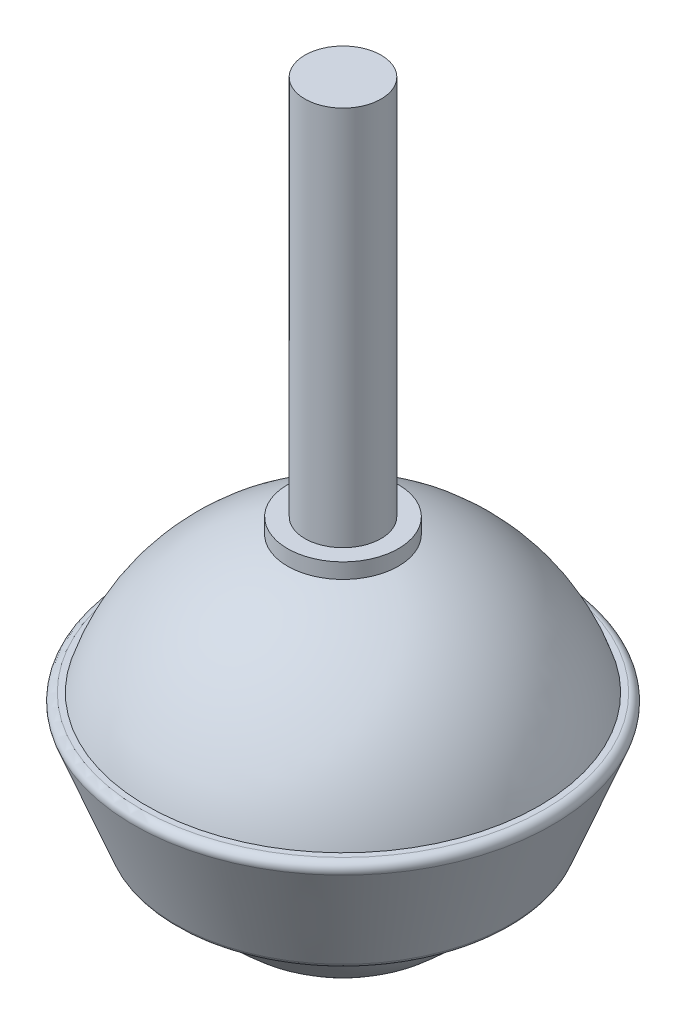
ISO-10303-21;
HEADER;
FILE_DESCRIPTION(('STEP AP214'),'2;1');
FILE_NAME('part.step','',(''),(''),'','','');
FILE_SCHEMA(('AUTOMOTIVE_DESIGN { 1 0 10303 214 1 1 1 1 }'));
ENDSEC;
DATA;
#1=APPLICATION_CONTEXT('core data for automotive mechanical design processes');
#2=APPLICATION_PROTOCOL_DEFINITION('international standard','automotive_design',2000,#1);
#3=PRODUCT_CONTEXT('',#1,'mechanical');
#4=PRODUCT('Part','Part','',(#3));
#5=PRODUCT_RELATED_PRODUCT_CATEGORY('part','',(#4));
#6=PRODUCT_DEFINITION_FORMATION('','',#4);
#7=PRODUCT_DEFINITION_CONTEXT('part definition',#1,'design');
#8=PRODUCT_DEFINITION('design','',#6,#7);
#9=PRODUCT_DEFINITION_SHAPE('','',#8);
#10=(LENGTH_UNIT() NAMED_UNIT(*) SI_UNIT(.MILLI.,.METRE.));
#11=(NAMED_UNIT(*) PLANE_ANGLE_UNIT() SI_UNIT($,.RADIAN.));
#12=(NAMED_UNIT(*) SI_UNIT($,.STERADIAN.) SOLID_ANGLE_UNIT());
#13=UNCERTAINTY_MEASURE_WITH_UNIT(LENGTH_MEASURE(1.E-05),#10,'distance_accuracy_value','');
#14=(GEOMETRIC_REPRESENTATION_CONTEXT(3) GLOBAL_UNCERTAINTY_ASSIGNED_CONTEXT((#13)) GLOBAL_UNIT_ASSIGNED_CONTEXT((#10,
#11,#12)) REPRESENTATION_CONTEXT('',''));
#15=CARTESIAN_POINT('',(0.,0.,0.));
#16=DIRECTION('',(0.,0.,1.));
#17=DIRECTION('',(1.,0.,0.));
#18=AXIS2_PLACEMENT_3D('',#15,#16,#17);
#19=CARTESIAN_POINT('',(0.,-78.,0.));
#20=DIRECTION('',(0.,1.,0.));
#21=DIRECTION('',(-1.,0.,0.));
#22=AXIS2_PLACEMENT_3D('',#19,#20,#21);
#23=SPHERICAL_SURFACE('',#22,20.);
#24=CARTESIAN_POINT('',(0.,-86.,0.));
#25=DIRECTION('',(0.,1.,0.));
#26=DIRECTION('',(-1.,0.,0.));
#27=AXIS2_PLACEMENT_3D('',#24,#25,#26);
#28=CIRCLE('',#27,18.3303027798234);
#29=CARTESIAN_POINT('',(-18.3303027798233,-86.,0.));
#30=VERTEX_POINT('',#29);
#31=EDGE_CURVE('E10',#30,#30,#28,.T.);
#32=ORIENTED_EDGE('',*,*,#31,.F.);
#33=EDGE_LOOP('',(#32));
#34=FACE_BOUND('',#33,.T.);
#35=ADVANCED_FACE('F30',(#34),#23,.T.);
#36=CARTESIAN_POINT('',(21.0674801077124,-86.,0.));
#37=DIRECTION('',(0.,1.,0.));
#38=DIRECTION('',(-1.,0.,0.));
#39=AXIS2_PLACEMENT_3D('',#36,#37,#38);
#40=PLANE('',#39);
#41=CARTESIAN_POINT('',(0.,-86.,0.));
#42=DIRECTION('',(0.,1.,0.));
#43=DIRECTION('',(-1.,0.,0.));
#44=AXIS2_PLACEMENT_3D('',#41,#42,#43);
#45=CIRCLE('',#44,21.0674801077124);
#46=CARTESIAN_POINT('',(-21.0674801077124,-86.,0.));
#47=VERTEX_POINT('',#46);
#48=EDGE_CURVE('E36',#47,#47,#45,.T.);
#49=ORIENTED_EDGE('',*,*,#48,.F.);
#50=EDGE_LOOP('',(#49));
#51=FACE_BOUND('',#50,.T.);
#52=ORIENTED_EDGE('',*,*,#31,.T.);
#53=EDGE_LOOP('',(#52));
#54=FACE_BOUND('',#53,.T.);
#55=ADVANCED_FACE('F114',(#51,#54),#40,.F.);
#56=CARTESIAN_POINT('',(0.,-85.,0.));
#57=DIRECTION('',(0.,1.,0.));
#58=DIRECTION('',(-1.,0.,0.));
#59=AXIS2_PLACEMENT_3D('',#56,#57,#58);
#60=TOROIDAL_SURFACE('',#59,21.0674801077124,1.);
#61=CARTESIAN_POINT('',(0.,-85.3638273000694,0.));
#62=DIRECTION('',(0.,1.,0.));
#63=DIRECTION('',(-1.,0.,0.));
#64=AXIS2_PLACEMENT_3D('',#61,#62,#63);
#65=CIRCLE('',#64,21.9989465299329);
#66=CARTESIAN_POINT('',(-21.9989465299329,-85.3638273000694,0.));
#67=VERTEX_POINT('',#66);
#68=EDGE_CURVE('E40',#67,#67,#65,.T.);
#69=ORIENTED_EDGE('',*,*,#68,.F.);
#70=EDGE_LOOP('',(#69));
#71=FACE_BOUND('',#70,.T.);
#72=ORIENTED_EDGE('',*,*,#48,.T.);
#73=EDGE_LOOP('',(#72));
#74=FACE_BOUND('',#73,.T.);
#75=ADVANCED_FACE('F109',(#71,#74),#60,.T.);
#76=CARTESIAN_POINT('',(0.,-85.3638273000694,0.));
#77=DIRECTION('',(0.,1.,0.));
#78=DIRECTION('',(-1.,0.,0.));
#79=AXIS2_PLACEMENT_3D('',#76,#77,#78);
#80=CONICAL_SURFACE('',#79,21.9989465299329,0.372373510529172);
#81=CARTESIAN_POINT('',(0.,-71.3638273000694,0.));
#82=DIRECTION('',(0.,1.,0.));
#83=DIRECTION('',(-1.,0.,0.));
#84=AXIS2_PLACEMENT_3D('',#81,#82,#83);
#85=CIRCLE('',#84,27.4672941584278);
#86=CARTESIAN_POINT('',(-27.4672941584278,-71.3638273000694,0.));
#87=VERTEX_POINT('',#86);
#88=EDGE_CURVE('E44',#87,#87,#85,.T.);
#89=ORIENTED_EDGE('',*,*,#88,.F.);
#90=EDGE_LOOP('',(#89));
#91=FACE_BOUND('',#90,.T.);
#92=ORIENTED_EDGE('',*,*,#68,.T.);
#93=EDGE_LOOP('',(#92));
#94=FACE_BOUND('',#93,.T.);
#95=ADVANCED_FACE('F103',(#91,#94),#80,.T.);
#96=CARTESIAN_POINT('',(0.,-71.,0.));
#97=DIRECTION('',(0.,1.,0.));
#98=DIRECTION('',(-1.,0.,0.));
#99=AXIS2_PLACEMENT_3D('',#96,#97,#98);
#100=TOROIDAL_SURFACE('',#99,26.5358277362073,0.999999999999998);
#101=CARTESIAN_POINT('',(0.,-70.,0.));
#102=DIRECTION('',(0.,1.,0.));
#103=DIRECTION('',(-1.,0.,0.));
#104=AXIS2_PLACEMENT_3D('',#101,#102,#103);
#105=CIRCLE('',#104,26.5358277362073);
#106=CARTESIAN_POINT('',(-26.5358277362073,-70.,0.));
#107=VERTEX_POINT('',#106);
#108=EDGE_CURVE('E49',#107,#107,#105,.T.);
#109=ORIENTED_EDGE('',*,*,#108,.F.);
#110=EDGE_LOOP('',(#109));
#111=FACE_BOUND('',#110,.T.);
#112=ORIENTED_EDGE('',*,*,#88,.T.);
#113=EDGE_LOOP('',(#112));
#114=FACE_BOUND('',#113,.T.);
#115=ADVANCED_FACE('F97',(#111,#114),#100,.T.);
#116=CARTESIAN_POINT('',(25.7875939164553,-70.,0.));
#117=DIRECTION('',(0.,-1.,0.));
#118=DIRECTION('',(1.,0.,0.));
#119=AXIS2_PLACEMENT_3D('',#116,#117,#118);
#120=PLANE('',#119);
#121=CARTESIAN_POINT('',(0.,-70.,0.));
#122=DIRECTION('',(0.,1.,0.));
#123=DIRECTION('',(-1.,0.,0.));
#124=AXIS2_PLACEMENT_3D('',#121,#122,#123);
#125=CIRCLE('',#124,25.7875939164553);
#126=CARTESIAN_POINT('',(25.7875939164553,-70.,0.));
#127=VERTEX_POINT('',#126);
#128=EDGE_CURVE('E52',#127,#127,#125,.T.);
#129=ORIENTED_EDGE('',*,*,#128,.F.);
#130=EDGE_LOOP('',(#129));
#131=FACE_BOUND('',#130,.T.);
#132=ORIENTED_EDGE('',*,*,#108,.T.);
#133=EDGE_LOOP('',(#132));
#134=FACE_BOUND('',#133,.T.);
#135=ADVANCED_FACE('F91',(#131,#134),#120,.F.);
#136=CARTESIAN_POINT('',(0.,-78.,0.));
#137=DIRECTION('',(0.,1.,0.));
#138=DIRECTION('',(1.,0.,0.));
#139=AXIS2_PLACEMENT_3D('',#136,#137,#138);
#140=SPHERICAL_SURFACE('',#139,27.);
#141=CARTESIAN_POINT('',(0.,-52.,0.));
#142=DIRECTION('',(0.,1.,0.));
#143=DIRECTION('',(-1.,0.,0.));
#144=AXIS2_PLACEMENT_3D('',#141,#142,#143);
#145=CIRCLE('',#144,7.28010988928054);
#146=CARTESIAN_POINT('',(7.28010988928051,-52.,0.));
#147=VERTEX_POINT('',#146);
#148=EDGE_CURVE('E55',#147,#147,#145,.T.);
#149=CARTESIAN_POINT('',(7.28010988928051,-52.,0.));
#150=CARTESIAN_POINT('',(7.55012338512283,-52.0756033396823,0.));
#151=CARTESIAN_POINT('',(7.81895824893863,-52.1554157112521,0.));
#152=CARTESIAN_POINT('',(8.35401179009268,-52.3233746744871,0.));
#153=CARTESIAN_POINT('',(8.62023046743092,-52.4115212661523,0.));
#154=CARTESIAN_POINT('',(9.14979271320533,-52.5960648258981,0.));
#155=CARTESIAN_POINT('',(9.4131362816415,-52.6924617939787,0.));
#156=CARTESIAN_POINT('',(9.93669285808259,-52.8934120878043,0.));
#157=CARTESIAN_POINT('',(10.1969058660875,-52.9979654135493,0.));
#158=CARTESIAN_POINT('',(10.7139487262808,-53.2151270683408,0.));
#159=CARTESIAN_POINT('',(10.9707785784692,-53.3277353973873,0.));
#160=CARTESIAN_POINT('',(11.4808058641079,-53.5608977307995,0.));
#161=CARTESIAN_POINT('',(11.7340032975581,-53.6814517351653,0.));
#162=CARTESIAN_POINT('',(12.2365199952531,-53.9303884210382,0.));
#163=CARTESIAN_POINT('',(12.4858392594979,-54.0587711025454,0.));
#164=CARTESIAN_POINT('',(12.9803576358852,-54.3232405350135,0.));
#165=CARTESIAN_POINT('',(13.2255567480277,-54.4593272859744,0.));
#166=CARTESIAN_POINT('',(13.7115968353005,-54.7390727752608,0.));
#167=CARTESIAN_POINT('',(13.9524378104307,-54.8827315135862,0.));
#168=CARTESIAN_POINT('',(14.4295278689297,-55.1774815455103,0.));
#169=CARTESIAN_POINT('',(14.6657769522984,-55.3285728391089,0.));
#170=CARTESIAN_POINT('',(15.1334539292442,-55.6380413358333,0.));
#171=CARTESIAN_POINT('',(15.3648818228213,-55.796418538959,0.));
#172=CARTESIAN_POINT('',(15.8226918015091,-56.1203051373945,0.));
#173=CARTESIAN_POINT('',(16.0490738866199,-56.2858145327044,0.));
#174=CARTESIAN_POINT('',(16.4965725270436,-56.6238048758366,0.));
#175=CARTESIAN_POINT('',(16.7176890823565,-56.7962858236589,0.));
#176=CARTESIAN_POINT('',(17.1544420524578,-57.1480518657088,0.));
#177=CARTESIAN_POINT('',(17.3700784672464,-57.3273369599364,0.));
#178=CARTESIAN_POINT('',(17.7956618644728,-57.6925372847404,0.));
#179=CARTESIAN_POINT('',(18.0056088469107,-57.8784525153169,0.));
#180=CARTESIAN_POINT('',(18.4196096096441,-58.2567326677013,0.));
#181=CARTESIAN_POINT('',(18.6236633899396,-58.4490975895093,0.));
#182=CARTESIAN_POINT('',(19.0256796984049,-58.8400904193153,0.));
#183=CARTESIAN_POINT('',(19.2236422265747,-59.0387183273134,0.));
#184=CARTESIAN_POINT('',(19.6132838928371,-59.4420443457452,0.));
#185=CARTESIAN_POINT('',(19.8049630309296,-59.646742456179,0.));
#186=CARTESIAN_POINT('',(20.1818518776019,-60.062010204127,0.));
#187=CARTESIAN_POINT('',(20.3670615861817,-60.2725798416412,0.));
#188=CARTESIAN_POINT('',(20.7308318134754,-60.699386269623,0.));
#189=CARTESIAN_POINT('',(20.9093923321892,-60.9156230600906,0.));
#190=CARTESIAN_POINT('',(21.2596908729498,-61.3535539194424,0.));
#191=CARTESIAN_POINT('',(21.4314288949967,-61.5752479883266,0.));
#192=CARTESIAN_POINT('',(21.7679157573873,-62.023878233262,0.));
#193=CARTESIAN_POINT('',(21.9326645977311,-62.2508144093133,0.));
#194=CARTESIAN_POINT('',(22.255013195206,-62.7097086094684,0.));
#195=CARTESIAN_POINT('',(22.4126129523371,-62.9416666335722,0.));
#196=CARTESIAN_POINT('',(22.7205104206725,-63.4103793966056,0.));
#197=CARTESIAN_POINT('',(22.8708081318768,-63.6471341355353,0.));
#198=CARTESIAN_POINT('',(23.163955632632,-64.1252105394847,0.));
#199=CARTESIAN_POINT('',(23.3068054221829,-64.3665322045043,0.));
#200=CARTESIAN_POINT('',(23.584918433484,-64.8535082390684,0.));
#201=CARTESIAN_POINT('',(23.7201816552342,-65.0991626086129,0.));
#202=CARTESIAN_POINT('',(23.982990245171,-65.594565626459,0.));
#203=CARTESIAN_POINT('',(24.1105356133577,-65.8443142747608,0.));
#204=CARTESIAN_POINT('',(24.3577847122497,-66.3476634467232,0.));
#205=CARTESIAN_POINT('',(24.4774884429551,-66.6012639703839,0.));
#206=CARTESIAN_POINT('',(24.7089380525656,-67.1120707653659,0.));
#207=CARTESIAN_POINT('',(24.8206839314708,-67.3692770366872,0.));
#208=CARTESIAN_POINT('',(25.0361095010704,-67.8870456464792,0.));
#209=CARTESIAN_POINT('',(25.1397891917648,-68.14760798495,0.));
#210=CARTESIAN_POINT('',(25.3389813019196,-68.6718359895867,0.));
#211=CARTESIAN_POINT('',(25.4344937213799,-68.9355016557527,0.));
#212=CARTESIAN_POINT('',(25.6172602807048,-69.4656798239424,0.));
#213=CARTESIAN_POINT('',(25.7045144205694,-69.7321923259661,0.));
#214=CARTESIAN_POINT('',(25.7875939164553,-70.,0.));
#215=B_SPLINE_CURVE_WITH_KNOTS('',3,(#149,#150,#151,#152,#153,#154,#155,#156,#157,#158,#159,
#160,#161,#162,#163,#164,#165,#166,#167,#168,#169,#170,#171,#172,#173,#174,#175,#176,#177,#178,
#179,#180,#181,#182,#183,#184,#185,#186,#187,#188,#189,#190,#191,#192,#193,#194,#195,#196,#197,
#198,#199,#200,#201,#202,#203,#204,#205,#206,#207,#208,#209,#210,#211,#212,#213,#214),
.UNSPECIFIED.,.F.,.F.,(4,2,2,2,2,2,2,2,2,2,2,2,2,2,2,2,2,2,2,2,2,2,2,2,2,2,2,2,2,2,2,2,4),(0.,
0.841160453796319,1.68232090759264,2.52348136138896,3.36464181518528,4.2058022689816,
5.04696272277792,5.88812317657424,6.72928363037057,7.57044408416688,8.41160453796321,
9.25276499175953,10.0939254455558,10.9350858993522,11.7762463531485,12.6174068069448,
13.4585672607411,14.2997277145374,15.1408881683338,15.9820486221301,16.8232090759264,
17.6643695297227,18.505529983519,19.3466904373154,20.1878508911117,21.029011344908,
21.8701717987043,22.7113322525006,23.552492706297,24.3936531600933,25.2348136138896,
26.0759740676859,26.9171345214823),.UNSPECIFIED.);
#216=EDGE_CURVE('BSEAM85',#147,#127,#215,.T.);
#217=ORIENTED_EDGE('',*,*,#148,.F.);
#218=ORIENTED_EDGE('',*,*,#128,.T.);
#219=ORIENTED_EDGE('',*,*,#216,.T.);
#220=ORIENTED_EDGE('',*,*,#216,.F.);
#221=EDGE_LOOP('',(#217,#219,#218,#220));
#222=FACE_BOUND('',#221,.T.);
#223=ADVANCED_FACE('F85',(#222),#140,.T.);
#224=CARTESIAN_POINT('',(0.,0.,0.));
#225=DIRECTION('',(0.,1.,0.));
#226=DIRECTION('',(-1.,0.,0.));
#227=AXIS2_PLACEMENT_3D('',#224,#225,#226);
#228=CYLINDRICAL_SURFACE('',#227,7.28010988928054);
#229=CARTESIAN_POINT('',(0.,-50.,0.));
#230=DIRECTION('',(0.,1.,0.));
#231=DIRECTION('',(-1.,0.,0.));
#232=AXIS2_PLACEMENT_3D('',#229,#230,#231);
#233=CIRCLE('',#232,7.28010988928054);
#234=CARTESIAN_POINT('',(-7.28010988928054,-50.,0.));
#235=VERTEX_POINT('',#234);
#236=EDGE_CURVE('E58',#235,#235,#233,.T.);
#237=ORIENTED_EDGE('',*,*,#236,.F.);
#238=EDGE_LOOP('',(#237));
#239=FACE_BOUND('',#238,.T.);
#240=ORIENTED_EDGE('',*,*,#148,.T.);
#241=EDGE_LOOP('',(#240));
#242=FACE_BOUND('',#241,.T.);
#243=ADVANCED_FACE('F79',(#239,#242),#228,.T.);
#244=CARTESIAN_POINT('',(5.00000000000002,-50.,0.));
#245=DIRECTION('',(0.,-1.,0.));
#246=DIRECTION('',(1.,0.,0.));
#247=AXIS2_PLACEMENT_3D('',#244,#245,#246);
#248=PLANE('',#247);
#249=CARTESIAN_POINT('',(0.,-50.,0.));
#250=DIRECTION('',(0.,1.,0.));
#251=DIRECTION('',(-1.,0.,0.));
#252=AXIS2_PLACEMENT_3D('',#249,#250,#251);
#253=CIRCLE('',#252,5.00000000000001);
#254=CARTESIAN_POINT('',(-5.,-50.,0.));
#255=VERTEX_POINT('',#254);
#256=EDGE_CURVE('E61',#255,#255,#253,.T.);
#257=ORIENTED_EDGE('',*,*,#256,.F.);
#258=EDGE_LOOP('',(#257));
#259=FACE_BOUND('',#258,.T.);
#260=ORIENTED_EDGE('',*,*,#236,.T.);
#261=EDGE_LOOP('',(#260));
#262=FACE_BOUND('',#261,.T.);
#263=ADVANCED_FACE('F73',(#259,#262),#248,.F.);
#264=CARTESIAN_POINT('',(0.,0.,0.));
#265=DIRECTION('',(0.,1.,0.));
#266=DIRECTION('',(-1.,0.,0.));
#267=AXIS2_PLACEMENT_3D('',#264,#265,#266);
#268=CYLINDRICAL_SURFACE('',#267,5.);
#269=CARTESIAN_POINT('',(0.,0.,0.));
#270=DIRECTION('',(0.,1.,0.));
#271=DIRECTION('',(-1.,0.,0.));
#272=AXIS2_PLACEMENT_3D('',#269,#270,#271);
#273=CIRCLE('',#272,5.);
#274=CARTESIAN_POINT('',(-5.,0.,0.));
#275=VERTEX_POINT('',#274);
#276=EDGE_CURVE('E64',#275,#275,#273,.T.);
#277=ORIENTED_EDGE('',*,*,#276,.F.);
#278=EDGE_LOOP('',(#277));
#279=FACE_BOUND('',#278,.T.);
#280=ORIENTED_EDGE('',*,*,#256,.T.);
#281=EDGE_LOOP('',(#280));
#282=FACE_BOUND('',#281,.T.);
#283=ADVANCED_FACE('F70',(#279,#282),#268,.T.);
#284=CARTESIAN_POINT('',(0.,0.,0.));
#285=DIRECTION('',(0.,-1.,0.));
#286=DIRECTION('',(1.,0.,0.));
#287=AXIS2_PLACEMENT_3D('',#284,#285,#286);
#288=PLANE('',#287);
#289=ORIENTED_EDGE('',*,*,#276,.T.);
#290=EDGE_LOOP('',(#289));
#291=FACE_BOUND('',#290,.T.);
#292=ADVANCED_FACE('F68',(#291),#288,.F.);
#293=CLOSED_SHELL('',(#35,#55,#75,#95,#115,#135,#223,#243,#263,#283,#292));
#294=MANIFOLD_SOLID_BREP('B2',#293);
#295=ADVANCED_BREP_SHAPE_REPRESENTATION('',(#18,#294),#14);
#296=SHAPE_DEFINITION_REPRESENTATION(#9,#295);
ENDSEC;
END-ISO-10303-21;
